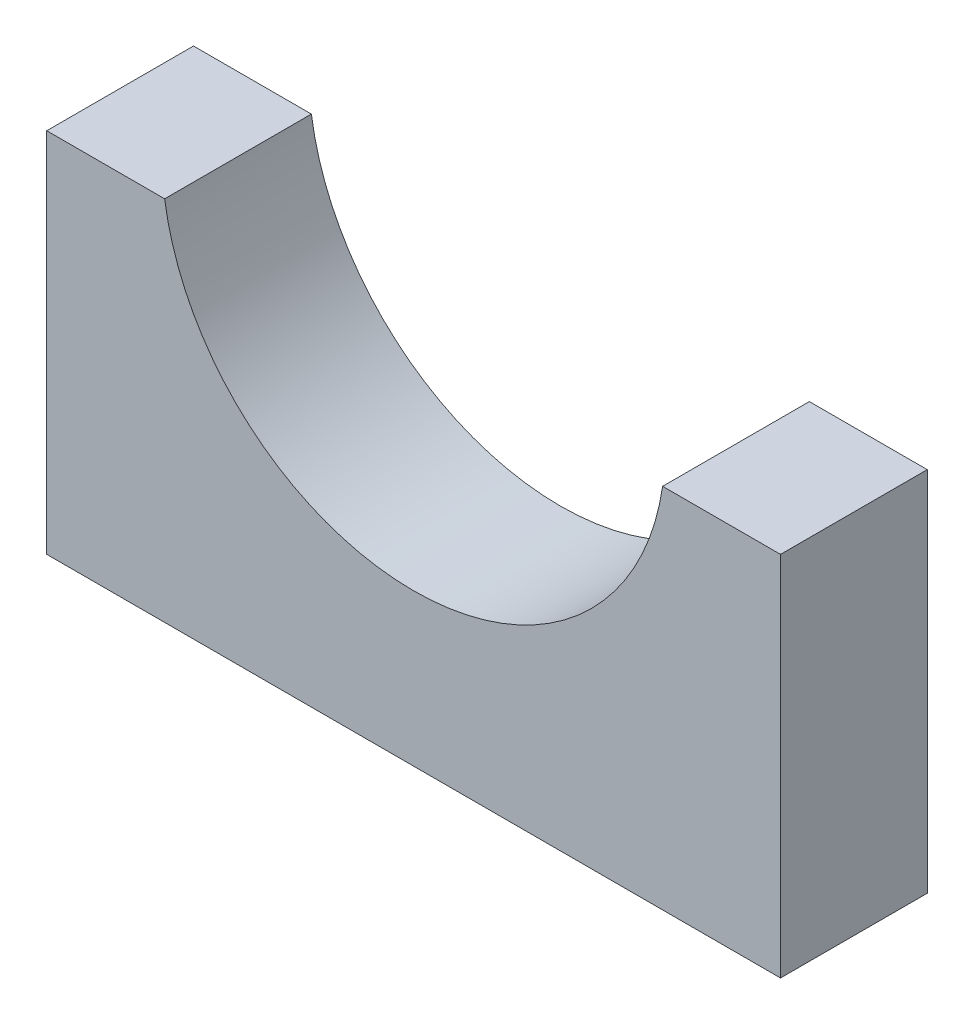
from build123d import *

# Parameters (mm, degrees)
BOSS_EXTRUDE1_DEPTH = 6.35


with BuildPart() as part:
    # Sketch1 → Boss-Extrude1 (new, symmetric)
    with BuildSketch(Plane.XY):
        with BuildLine():
            Line((-31.75, 15.875), (-31.75, -15.875))
            Line((-31.75, -15.875), (31.75, -15.875))
            Line((31.75, -15.875), (31.75, 15.875))
            Line((31.75, 15.875), (21.547843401, 15.875))
            ThreePointArc((21.547843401, 15.875), (0, -2.7305), (-21.547843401, 15.875))
            Line((-21.547843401, 15.875), (-31.75, 15.875))
        make_face()
    extrude(amount=BOSS_EXTRUDE1_DEPTH, both=True)


solid = part.part
